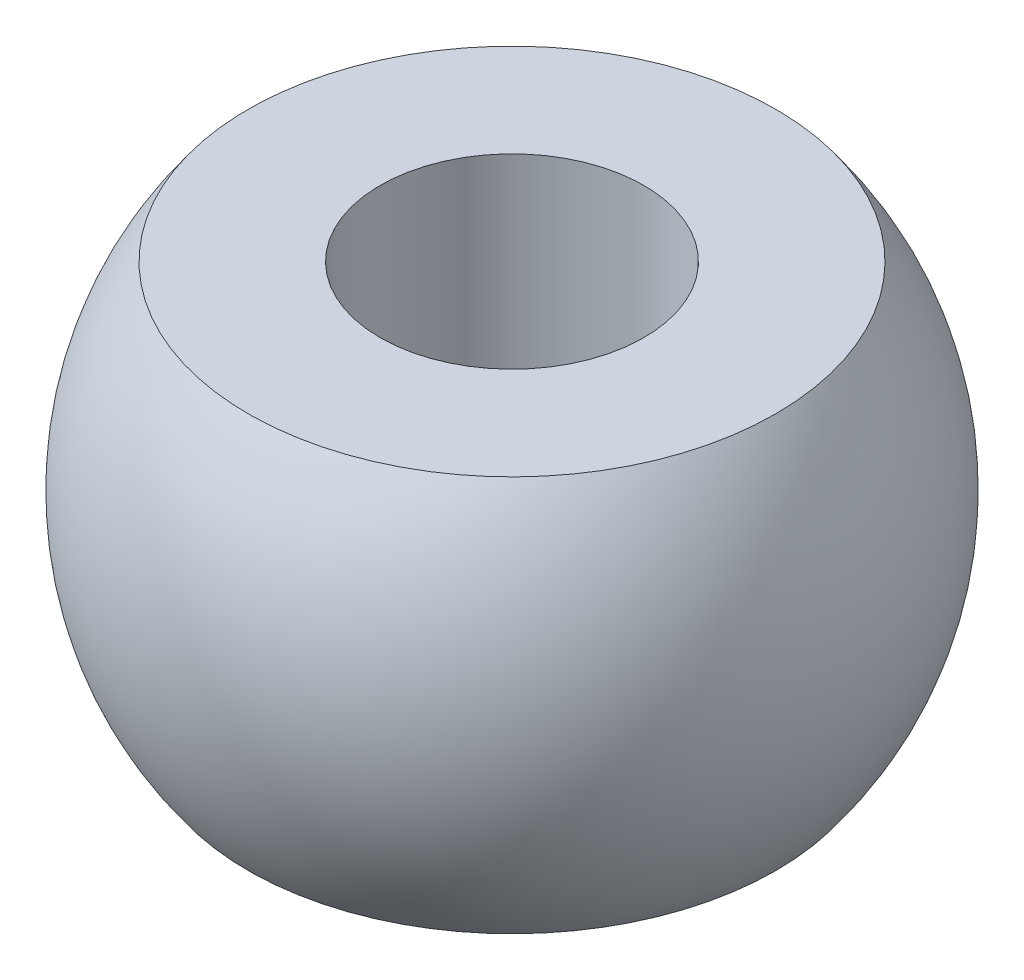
from build123d import *


with BuildPart() as part:
    # Esquisse1 → R_volution1 (revolve)
    with BuildSketch(Plane.XY, mode=Mode.PRIVATE) as r_volution1_sk:
        with BuildLine():
            Line((4, 6), (8, 6))
            ThreePointArc((8, 6), (10, 0), (8, -6))
            Line((8, -6), (4, -6))
            Line((4, -6), (4, 6))
        make_face()
    revolve(r_volution1_sk.sketch.rotate(Axis((0, 43.466979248, 0), (0, -1, 0)), 90), axis=Axis((0, 43.466979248, 0), (0, -1, 0)))


solid = part.part
